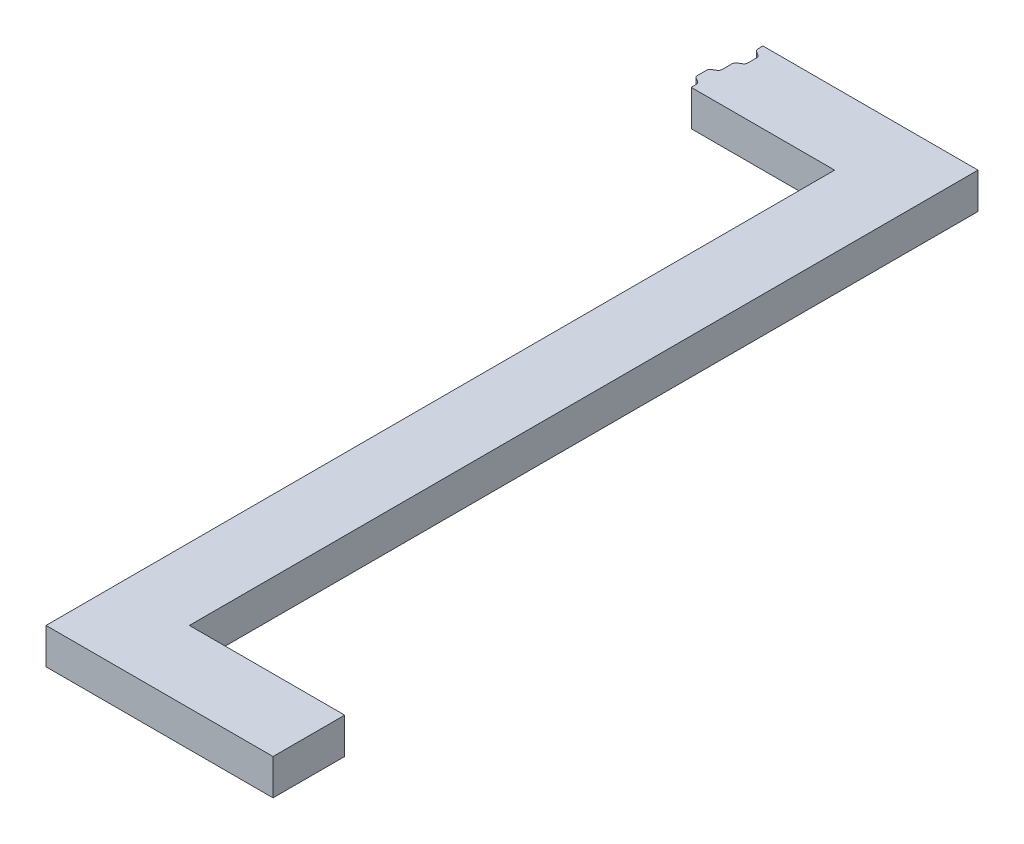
ISO-10303-21;
HEADER;
FILE_DESCRIPTION(('STEP AP214'),'2;1');
FILE_NAME('part.step','',(''),(''),'','','');
FILE_SCHEMA(('AUTOMOTIVE_DESIGN { 1 0 10303 214 1 1 1 1 }'));
ENDSEC;
DATA;
#1=APPLICATION_CONTEXT('core data for automotive mechanical design processes');
#2=APPLICATION_PROTOCOL_DEFINITION('international standard','automotive_design',2000,#1);
#3=PRODUCT_CONTEXT('',#1,'mechanical');
#4=PRODUCT('Part','Part','',(#3));
#5=PRODUCT_RELATED_PRODUCT_CATEGORY('part','',(#4));
#6=PRODUCT_DEFINITION_FORMATION('','',#4);
#7=PRODUCT_DEFINITION_CONTEXT('part definition',#1,'design');
#8=PRODUCT_DEFINITION('design','',#6,#7);
#9=PRODUCT_DEFINITION_SHAPE('','',#8);
#10=(LENGTH_UNIT() NAMED_UNIT(*) SI_UNIT(.MILLI.,.METRE.));
#11=(NAMED_UNIT(*) PLANE_ANGLE_UNIT() SI_UNIT($,.RADIAN.));
#12=(NAMED_UNIT(*) SI_UNIT($,.STERADIAN.) SOLID_ANGLE_UNIT());
#13=UNCERTAINTY_MEASURE_WITH_UNIT(LENGTH_MEASURE(1.E-05),#10,'distance_accuracy_value','');
#14=(GEOMETRIC_REPRESENTATION_CONTEXT(3) GLOBAL_UNCERTAINTY_ASSIGNED_CONTEXT((#13)) GLOBAL_UNIT_ASSIGNED_CONTEXT((#10,
#11,#12)) REPRESENTATION_CONTEXT('',''));
#15=CARTESIAN_POINT('',(0.,0.,0.));
#16=DIRECTION('',(0.,0.,1.));
#17=DIRECTION('',(1.,0.,0.));
#18=AXIS2_PLACEMENT_3D('',#15,#16,#17);
#19=CARTESIAN_POINT('',(90.0000000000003,15.,300.));
#20=DIRECTION('',(0.,0.,1.));
#21=DIRECTION('',(1.,0.,0.));
#22=AXIS2_PLACEMENT_3D('',#19,#20,#21);
#23=PLANE('',#22);
#24=DIRECTION('',(-1.,0.,0.));
#25=VECTOR('',#24,1.);
#26=CARTESIAN_POINT('',(90.0000000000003,0.,300.));
#27=LINE('',#26,#25);
#28=CARTESIAN_POINT('',(155.,0.,300.));
#29=VERTEX_POINT('',#28);
#30=CARTESIAN_POINT('',(90.0000000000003,0.,300.));
#31=VERTEX_POINT('',#30);
#32=EDGE_CURVE('E202',#29,#31,#27,.T.);
#33=ORIENTED_EDGE('',*,*,#32,.T.);
#34=DIRECTION('',(0.,-1.,0.));
#35=VECTOR('',#34,1.);
#36=CARTESIAN_POINT('',(90.0000000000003,15.,300.));
#37=LINE('',#36,#35);
#38=CARTESIAN_POINT('',(90.0000000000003,15.,300.));
#39=VERTEX_POINT('',#38);
#40=EDGE_CURVE('E11',#39,#31,#37,.T.);
#41=ORIENTED_EDGE('',*,*,#40,.F.);
#42=DIRECTION('',(-1.,0.,0.));
#43=VECTOR('',#42,1.);
#44=CARTESIAN_POINT('',(90.0000000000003,15.,300.));
#45=LINE('',#44,#43);
#46=CARTESIAN_POINT('',(155.,15.,300.));
#47=VERTEX_POINT('',#46);
#48=EDGE_CURVE('E265',#47,#39,#45,.T.);
#49=ORIENTED_EDGE('',*,*,#48,.F.);
#50=DIRECTION('',(0.,-1.,0.));
#51=VECTOR('',#50,1.);
#52=CARTESIAN_POINT('',(155.,15.,300.));
#53=LINE('',#52,#51);
#54=EDGE_CURVE('E215',#47,#29,#53,.T.);
#55=ORIENTED_EDGE('',*,*,#54,.T.);
#56=EDGE_LOOP('',(#33,#41,#49,#55));
#57=FACE_BOUND('',#56,.T.);
#58=ADVANCED_FACE('F26',(#57),#23,.F.);
#59=CARTESIAN_POINT('',(90.,15.,-30.));
#60=DIRECTION('',(-1.,0.,0.));
#61=DIRECTION('',(0.,0.,1.));
#62=AXIS2_PLACEMENT_3D('',#59,#60,#61);
#63=PLANE('',#62);
#64=DIRECTION('',(0.,0.,-1.));
#65=VECTOR('',#64,1.);
#66=CARTESIAN_POINT('',(90.,0.,-30.));
#67=LINE('',#66,#65);
#68=CARTESIAN_POINT('',(90.,0.,-30.));
#69=VERTEX_POINT('',#68);
#70=EDGE_CURVE('E198',#31,#69,#67,.T.);
#71=ORIENTED_EDGE('',*,*,#70,.T.);
#72=DIRECTION('',(0.,-1.,0.));
#73=VECTOR('',#72,1.);
#74=CARTESIAN_POINT('',(90.,15.,-30.));
#75=LINE('',#74,#73);
#76=CARTESIAN_POINT('',(90.,15.,-30.));
#77=VERTEX_POINT('',#76);
#78=EDGE_CURVE('E33',#77,#69,#75,.T.);
#79=ORIENTED_EDGE('',*,*,#78,.F.);
#80=DIRECTION('',(0.,0.,-1.));
#81=VECTOR('',#80,1.);
#82=CARTESIAN_POINT('',(90.,15.,-30.));
#83=LINE('',#82,#81);
#84=EDGE_CURVE('E211',#39,#77,#83,.T.);
#85=ORIENTED_EDGE('',*,*,#84,.F.);
#86=ORIENTED_EDGE('',*,*,#40,.T.);
#87=EDGE_LOOP('',(#71,#79,#85,#86));
#88=FACE_BOUND('',#87,.T.);
#89=ADVANCED_FACE('F210',(#88),#63,.F.);
#90=CARTESIAN_POINT('',(0.199999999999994,15.,-30.));
#91=DIRECTION('',(0.,0.,1.));
#92=DIRECTION('',(1.,0.,0.));
#93=AXIS2_PLACEMENT_3D('',#90,#91,#92);
#94=PLANE('',#93);
#95=DIRECTION('',(-1.,0.,0.));
#96=VECTOR('',#95,1.);
#97=CARTESIAN_POINT('',(0.199999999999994,0.,-30.));
#98=LINE('',#97,#96);
#99=CARTESIAN_POINT('',(0.199999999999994,0.,-30.));
#100=VERTEX_POINT('',#99);
#101=EDGE_CURVE('E204',#69,#100,#98,.T.);
#102=ORIENTED_EDGE('',*,*,#101,.T.);
#103=DIRECTION('',(0.,-1.,0.));
#104=VECTOR('',#103,1.);
#105=CARTESIAN_POINT('',(0.199999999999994,15.,-30.));
#106=LINE('',#105,#104);
#107=CARTESIAN_POINT('',(0.199999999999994,15.,-30.));
#108=VERTEX_POINT('',#107);
#109=EDGE_CURVE('E381',#108,#100,#106,.T.);
#110=ORIENTED_EDGE('',*,*,#109,.F.);
#111=DIRECTION('',(-1.,0.,0.));
#112=VECTOR('',#111,1.);
#113=CARTESIAN_POINT('',(0.199999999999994,15.,-30.));
#114=LINE('',#113,#112);
#115=EDGE_CURVE('E268',#77,#108,#114,.T.);
#116=ORIENTED_EDGE('',*,*,#115,.F.);
#117=ORIENTED_EDGE('',*,*,#78,.T.);
#118=EDGE_LOOP('',(#102,#110,#116,#117));
#119=FACE_BOUND('',#118,.T.);
#120=ADVANCED_FACE('F385',(#119),#94,.F.);
#121=CARTESIAN_POINT('',(0.199999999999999,15.,-29.8));
#122=DIRECTION('',(0.,-1.,0.));
#123=DIRECTION('',(0.,0.,-1.));
#124=AXIS2_PLACEMENT_3D('',#121,#122,#123);
#125=CYLINDRICAL_SURFACE('',#124,0.200000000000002);
#126=CARTESIAN_POINT('',(0.199999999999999,0.,-29.8));
#127=DIRECTION('',(0.,1.,0.));
#128=DIRECTION('',(0.,0.,-1.));
#129=AXIS2_PLACEMENT_3D('',#126,#127,#128);
#130=CIRCLE('',#129,0.200000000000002);
#131=CARTESIAN_POINT('',(0.,0.,-29.8));
#132=VERTEX_POINT('',#131);
#133=EDGE_CURVE('E219',#100,#132,#130,.T.);
#134=ORIENTED_EDGE('',*,*,#133,.T.);
#135=DIRECTION('',(0.,-1.,0.));
#136=VECTOR('',#135,1.);
#137=CARTESIAN_POINT('',(0.,15.,-29.8));
#138=LINE('',#137,#136);
#139=CARTESIAN_POINT('',(0.,15.,-29.8));
#140=VERTEX_POINT('',#139);
#141=EDGE_CURVE('E378',#140,#132,#138,.T.);
#142=ORIENTED_EDGE('',*,*,#141,.F.);
#143=CARTESIAN_POINT('',(0.199999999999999,15.,-29.8));
#144=DIRECTION('',(0.,1.,0.));
#145=DIRECTION('',(0.,0.,-1.));
#146=AXIS2_PLACEMENT_3D('',#143,#144,#145);
#147=CIRCLE('',#146,0.200000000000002);
#148=EDGE_CURVE('E270',#108,#140,#147,.T.);
#149=ORIENTED_EDGE('',*,*,#148,.F.);
#150=ORIENTED_EDGE('',*,*,#109,.T.);
#151=EDGE_LOOP('',(#134,#142,#149,#150));
#152=FACE_BOUND('',#151,.T.);
#153=ADVANCED_FACE('F393',(#152),#125,.T.);
#154=CARTESIAN_POINT('',(0.,15.,-29.8));
#155=DIRECTION('',(1.,0.,0.));
#156=DIRECTION('',(0.,0.,-1.));
#157=AXIS2_PLACEMENT_3D('',#154,#155,#156);
#158=PLANE('',#157);
#159=DIRECTION('',(0.,0.,1.));
#160=VECTOR('',#159,1.);
#161=CARTESIAN_POINT('',(0.,0.,-29.8));
#162=LINE('',#161,#160);
#163=CARTESIAN_POINT('',(0.,0.,-27.9237604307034));
#164=VERTEX_POINT('',#163);
#165=EDGE_CURVE('E221',#132,#164,#162,.T.);
#166=ORIENTED_EDGE('',*,*,#165,.T.);
#167=DIRECTION('',(0.,-1.,0.));
#168=VECTOR('',#167,1.);
#169=CARTESIAN_POINT('',(0.,15.,-27.9237604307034));
#170=LINE('',#169,#168);
#171=CARTESIAN_POINT('',(0.,15.,-27.9237604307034));
#172=VERTEX_POINT('',#171);
#173=EDGE_CURVE('E375',#172,#164,#170,.T.);
#174=ORIENTED_EDGE('',*,*,#173,.F.);
#175=DIRECTION('',(0.,0.,1.));
#176=VECTOR('',#175,1.);
#177=CARTESIAN_POINT('',(0.,15.,-29.8));
#178=LINE('',#177,#176);
#179=EDGE_CURVE('E272',#140,#172,#178,.T.);
#180=ORIENTED_EDGE('',*,*,#179,.F.);
#181=ORIENTED_EDGE('',*,*,#141,.T.);
#182=EDGE_LOOP('',(#166,#174,#180,#181));
#183=FACE_BOUND('',#182,.T.);
#184=ADVANCED_FACE('F396',(#183),#158,.F.);
#185=CARTESIAN_POINT('',(1.6,15.,-27.9237604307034));
#186=DIRECTION('',(0.,-1.,0.));
#187=DIRECTION('',(0.,0.,-1.));
#188=AXIS2_PLACEMENT_3D('',#185,#186,#187);
#189=CYLINDRICAL_SURFACE('',#188,1.60000000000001);
#190=CARTESIAN_POINT('',(1.6,0.,-27.9237604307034));
#191=DIRECTION('',(0.,1.,0.));
#192=DIRECTION('',(0.,0.,1.));
#193=AXIS2_PLACEMENT_3D('',#190,#191,#192);
#194=CIRCLE('',#193,1.60000000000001);
#195=CARTESIAN_POINT('',(0.800000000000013,0.,-26.5381197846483));
#196=VERTEX_POINT('',#195);
#197=EDGE_CURVE('E223',#164,#196,#194,.T.);
#198=ORIENTED_EDGE('',*,*,#197,.T.);
#199=DIRECTION('',(0.,-1.,0.));
#200=VECTOR('',#199,1.);
#201=CARTESIAN_POINT('',(0.800000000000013,15.,-26.5381197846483));
#202=LINE('',#201,#200);
#203=CARTESIAN_POINT('',(0.800000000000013,15.,-26.5381197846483));
#204=VERTEX_POINT('',#203);
#205=EDGE_CURVE('E372',#204,#196,#202,.T.);
#206=ORIENTED_EDGE('',*,*,#205,.F.);
#207=CARTESIAN_POINT('',(1.6,15.,-27.9237604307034));
#208=DIRECTION('',(0.,1.,0.));
#209=DIRECTION('',(0.,0.,1.));
#210=AXIS2_PLACEMENT_3D('',#207,#208,#209);
#211=CIRCLE('',#210,1.60000000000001);
#212=EDGE_CURVE('E274',#172,#204,#211,.T.);
#213=ORIENTED_EDGE('',*,*,#212,.F.);
#214=ORIENTED_EDGE('',*,*,#173,.T.);
#215=EDGE_LOOP('',(#198,#206,#213,#214));
#216=FACE_BOUND('',#215,.T.);
#217=ADVANCED_FACE('F401',(#216),#189,.T.);
#218=CARTESIAN_POINT('',(0.800000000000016,15.,-26.5381197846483));
#219=DIRECTION('',(0.499999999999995,0.,-0.866025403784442));
#220=DIRECTION('',(-0.866025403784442,0.,-0.499999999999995));
#221=AXIS2_PLACEMENT_3D('',#218,#219,#220);
#222=PLANE('',#221);
#223=DIRECTION('',(0.866025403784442,0.,0.499999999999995));
#224=VECTOR('',#223,1.);
#225=CARTESIAN_POINT('',(0.800000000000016,0.,-26.5381197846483));
#226=LINE('',#225,#224);
#227=CARTESIAN_POINT('',(2.19999999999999,0.,-25.7298294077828));
#228=VERTEX_POINT('',#227);
#229=EDGE_CURVE('E225',#196,#228,#226,.T.);
#230=ORIENTED_EDGE('',*,*,#229,.T.);
#231=DIRECTION('',(0.,-1.,0.));
#232=VECTOR('',#231,1.);
#233=CARTESIAN_POINT('',(2.19999999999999,15.,-25.7298294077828));
#234=LINE('',#233,#232);
#235=CARTESIAN_POINT('',(2.19999999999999,15.,-25.7298294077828));
#236=VERTEX_POINT('',#235);
#237=EDGE_CURVE('E369',#236,#228,#234,.T.);
#238=ORIENTED_EDGE('',*,*,#237,.F.);
#239=DIRECTION('',(0.866025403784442,0.,0.499999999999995));
#240=VECTOR('',#239,1.);
#241=CARTESIAN_POINT('',(0.800000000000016,15.,-26.5381197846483));
#242=LINE('',#241,#240);
#243=EDGE_CURVE('E276',#204,#236,#242,.T.);
#244=ORIENTED_EDGE('',*,*,#243,.F.);
#245=ORIENTED_EDGE('',*,*,#205,.T.);
#246=EDGE_LOOP('',(#230,#238,#244,#245));
#247=FACE_BOUND('',#246,.T.);
#248=ADVANCED_FACE('F407',(#247),#222,.F.);
#249=CARTESIAN_POINT('',(1.40000000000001,15.,-24.3441887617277));
#250=DIRECTION('',(0.,-1.,0.));
#251=DIRECTION('',(0.,0.,-1.));
#252=AXIS2_PLACEMENT_3D('',#249,#250,#251);
#253=CYLINDRICAL_SURFACE('',#252,1.6);
#254=CARTESIAN_POINT('',(1.40000000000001,0.,-24.3441887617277));
#255=DIRECTION('',(0.,-1.,0.));
#256=DIRECTION('',(0.,0.,-1.));
#257=AXIS2_PLACEMENT_3D('',#254,#255,#256);
#258=CIRCLE('',#257,1.6);
#259=CARTESIAN_POINT('',(3.,0.,-24.3441887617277));
#260=VERTEX_POINT('',#259);
#261=EDGE_CURVE('E227',#228,#260,#258,.T.);
#262=ORIENTED_EDGE('',*,*,#261,.T.);
#263=DIRECTION('',(0.,-1.,0.));
#264=VECTOR('',#263,1.);
#265=CARTESIAN_POINT('',(3.,15.,-24.3441887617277));
#266=LINE('',#265,#264);
#267=CARTESIAN_POINT('',(3.,15.,-24.3441887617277));
#268=VERTEX_POINT('',#267);
#269=EDGE_CURVE('E366',#268,#260,#266,.T.);
#270=ORIENTED_EDGE('',*,*,#269,.F.);
#271=CARTESIAN_POINT('',(1.40000000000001,15.,-24.3441887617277));
#272=DIRECTION('',(0.,-1.,0.));
#273=DIRECTION('',(0.,0.,-1.));
#274=AXIS2_PLACEMENT_3D('',#271,#272,#273);
#275=CIRCLE('',#274,1.6);
#276=EDGE_CURVE('E278',#236,#268,#275,.T.);
#277=ORIENTED_EDGE('',*,*,#276,.F.);
#278=ORIENTED_EDGE('',*,*,#237,.T.);
#279=EDGE_LOOP('',(#262,#270,#277,#278));
#280=FACE_BOUND('',#279,.T.);
#281=ADVANCED_FACE('F411',(#280),#253,.F.);
#282=CARTESIAN_POINT('',(3.,15.,-24.3441887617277));
#283=DIRECTION('',(1.,0.,0.));
#284=DIRECTION('',(0.,0.,-1.));
#285=AXIS2_PLACEMENT_3D('',#282,#283,#284);
#286=PLANE('',#285);
#287=DIRECTION('',(0.,0.,1.));
#288=VECTOR('',#287,1.);
#289=CARTESIAN_POINT('',(3.,0.,-24.3441887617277));
#290=LINE('',#289,#288);
#291=CARTESIAN_POINT('',(3.00000000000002,0.,-20.6603785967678));
#292=VERTEX_POINT('',#291);
#293=EDGE_CURVE('E229',#260,#292,#290,.T.);
#294=ORIENTED_EDGE('',*,*,#293,.T.);
#295=DIRECTION('',(0.,-1.,0.));
#296=VECTOR('',#295,1.);
#297=CARTESIAN_POINT('',(3.00000000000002,15.,-20.6603785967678));
#298=LINE('',#297,#296);
#299=CARTESIAN_POINT('',(3.00000000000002,15.,-20.6603785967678));
#300=VERTEX_POINT('',#299);
#301=EDGE_CURVE('E363',#300,#292,#298,.T.);
#302=ORIENTED_EDGE('',*,*,#301,.F.);
#303=DIRECTION('',(0.,0.,1.));
#304=VECTOR('',#303,1.);
#305=CARTESIAN_POINT('',(3.,15.,-24.3441887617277));
#306=LINE('',#305,#304);
#307=EDGE_CURVE('E280',#268,#300,#306,.T.);
#308=ORIENTED_EDGE('',*,*,#307,.F.);
#309=ORIENTED_EDGE('',*,*,#269,.T.);
#310=EDGE_LOOP('',(#294,#302,#308,#309));
#311=FACE_BOUND('',#310,.T.);
#312=ADVANCED_FACE('F416',(#311),#286,.F.);
#313=CARTESIAN_POINT('',(1.40000000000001,15.,-20.6603785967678));
#314=DIRECTION('',(0.,-1.,0.));
#315=DIRECTION('',(0.,0.,-1.));
#316=AXIS2_PLACEMENT_3D('',#313,#314,#315);
#317=CYLINDRICAL_SURFACE('',#316,1.6);
#318=CARTESIAN_POINT('',(1.40000000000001,0.,-20.6603785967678));
#319=DIRECTION('',(0.,-1.,0.));
#320=DIRECTION('',(0.,0.,-1.));
#321=AXIS2_PLACEMENT_3D('',#318,#319,#320);
#322=CIRCLE('',#321,1.6);
#323=CARTESIAN_POINT('',(2.20215355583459,0.,-19.2759835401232));
#324=VERTEX_POINT('',#323);
#325=EDGE_CURVE('E231',#292,#324,#322,.T.);
#326=ORIENTED_EDGE('',*,*,#325,.T.);
#327=DIRECTION('',(0.,-1.,0.));
#328=VECTOR('',#327,1.);
#329=CARTESIAN_POINT('',(2.20215355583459,15.,-19.2759835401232));
#330=LINE('',#329,#328);
#331=CARTESIAN_POINT('',(2.20215355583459,15.,-19.2759835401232));
#332=VERTEX_POINT('',#331);
#333=EDGE_CURVE('E360',#332,#324,#330,.T.);
#334=ORIENTED_EDGE('',*,*,#333,.F.);
#335=CARTESIAN_POINT('',(1.40000000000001,15.,-20.6603785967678));
#336=DIRECTION('',(0.,-1.,0.));
#337=DIRECTION('',(0.,0.,-1.));
#338=AXIS2_PLACEMENT_3D('',#335,#336,#337);
#339=CIRCLE('',#338,1.6);
#340=EDGE_CURVE('E282',#300,#332,#339,.T.);
#341=ORIENTED_EDGE('',*,*,#340,.F.);
#342=ORIENTED_EDGE('',*,*,#301,.T.);
#343=EDGE_LOOP('',(#326,#334,#341,#342));
#344=FACE_BOUND('',#343,.T.);
#345=ADVANCED_FACE('F422',(#344),#317,.F.);
#346=CARTESIAN_POINT('',(2.20215355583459,15.,-19.2759835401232));
#347=DIRECTION('',(0.501345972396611,0.,0.865246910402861));
#348=DIRECTION('',(0.865246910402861,0.,-0.501345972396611));
#349=AXIS2_PLACEMENT_3D('',#346,#347,#348);
#350=PLANE('',#349);
#351=DIRECTION('',(-0.865246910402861,0.,0.501345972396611));
#352=VECTOR('',#351,1.);
#353=CARTESIAN_POINT('',(2.20215355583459,0.,-19.2759835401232));
#354=LINE('',#353,#352);
#355=CARTESIAN_POINT('',(0.797846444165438,0.,-18.4622924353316));
#356=VERTEX_POINT('',#355);
#357=EDGE_CURVE('E233',#324,#356,#354,.T.);
#358=ORIENTED_EDGE('',*,*,#357,.T.);
#359=DIRECTION('',(0.,-1.,0.));
#360=VECTOR('',#359,1.);
#361=CARTESIAN_POINT('',(0.797846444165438,15.,-18.4622924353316));
#362=LINE('',#361,#360);
#363=CARTESIAN_POINT('',(0.797846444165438,15.,-18.4622924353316));
#364=VERTEX_POINT('',#363);
#365=EDGE_CURVE('E357',#364,#356,#362,.T.);
#366=ORIENTED_EDGE('',*,*,#365,.F.);
#367=DIRECTION('',(-0.865246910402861,0.,0.501345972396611));
#368=VECTOR('',#367,1.);
#369=CARTESIAN_POINT('',(2.20215355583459,15.,-19.2759835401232));
#370=LINE('',#369,#368);
#371=EDGE_CURVE('E284',#332,#364,#370,.T.);
#372=ORIENTED_EDGE('',*,*,#371,.F.);
#373=ORIENTED_EDGE('',*,*,#333,.T.);
#374=EDGE_LOOP('',(#358,#366,#372,#373));
#375=FACE_BOUND('',#374,.T.);
#376=ADVANCED_FACE('F426',(#375),#350,.F.);
#377=CARTESIAN_POINT('',(1.6,15.,-17.077897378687));
#378=DIRECTION('',(0.,-1.,0.));
#379=DIRECTION('',(0.,0.,-1.));
#380=AXIS2_PLACEMENT_3D('',#377,#378,#379);
#381=CYLINDRICAL_SURFACE('',#380,1.6);
#382=CARTESIAN_POINT('',(1.6,0.,-17.077897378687));
#383=DIRECTION('',(0.,1.,0.));
#384=DIRECTION('',(0.,0.,1.));
#385=AXIS2_PLACEMENT_3D('',#382,#383,#384);
#386=CIRCLE('',#385,1.6);
#387=CARTESIAN_POINT('',(0.,0.,-17.077897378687));
#388=VERTEX_POINT('',#387);
#389=EDGE_CURVE('E235',#356,#388,#386,.T.);
#390=ORIENTED_EDGE('',*,*,#389,.T.);
#391=DIRECTION('',(0.,-1.,0.));
#392=VECTOR('',#391,1.);
#393=CARTESIAN_POINT('',(0.,15.,-17.077897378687));
#394=LINE('',#393,#392);
#395=CARTESIAN_POINT('',(0.,15.,-17.077897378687));
#396=VERTEX_POINT('',#395);
#397=EDGE_CURVE('E354',#396,#388,#394,.T.);
#398=ORIENTED_EDGE('',*,*,#397,.F.);
#399=CARTESIAN_POINT('',(1.6,15.,-17.077897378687));
#400=DIRECTION('',(0.,1.,0.));
#401=DIRECTION('',(0.,0.,1.));
#402=AXIS2_PLACEMENT_3D('',#399,#400,#401);
#403=CIRCLE('',#402,1.6);
#404=EDGE_CURVE('E286',#364,#396,#403,.T.);
#405=ORIENTED_EDGE('',*,*,#404,.F.);
#406=ORIENTED_EDGE('',*,*,#365,.T.);
#407=EDGE_LOOP('',(#390,#398,#405,#406));
#408=FACE_BOUND('',#407,.T.);
#409=ADVANCED_FACE('F431',(#408),#381,.T.);
#410=CARTESIAN_POINT('',(0.,15.,-17.077897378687));
#411=DIRECTION('',(1.,0.,0.));
#412=DIRECTION('',(0.,0.,-1.));
#413=AXIS2_PLACEMENT_3D('',#410,#411,#412);
#414=PLANE('',#413);
#415=DIRECTION('',(0.,0.,1.));
#416=VECTOR('',#415,1.);
#417=CARTESIAN_POINT('',(0.,0.,-17.077897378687));
#418=LINE('',#417,#416);
#419=CARTESIAN_POINT('',(0.,0.,-12.922102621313));
#420=VERTEX_POINT('',#419);
#421=EDGE_CURVE('E237',#388,#420,#418,.T.);
#422=ORIENTED_EDGE('',*,*,#421,.T.);
#423=DIRECTION('',(0.,-1.,0.));
#424=VECTOR('',#423,1.);
#425=CARTESIAN_POINT('',(0.,15.,-12.922102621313));
#426=LINE('',#425,#424);
#427=CARTESIAN_POINT('',(0.,15.,-12.922102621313));
#428=VERTEX_POINT('',#427);
#429=EDGE_CURVE('E351',#428,#420,#426,.T.);
#430=ORIENTED_EDGE('',*,*,#429,.F.);
#431=DIRECTION('',(0.,0.,1.));
#432=VECTOR('',#431,1.);
#433=CARTESIAN_POINT('',(0.,15.,-17.077897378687));
#434=LINE('',#433,#432);
#435=EDGE_CURVE('E288',#396,#428,#434,.T.);
#436=ORIENTED_EDGE('',*,*,#435,.F.);
#437=ORIENTED_EDGE('',*,*,#397,.T.);
#438=EDGE_LOOP('',(#422,#430,#436,#437));
#439=FACE_BOUND('',#438,.T.);
#440=ADVANCED_FACE('F437',(#439),#414,.F.);
#441=CARTESIAN_POINT('',(-1.6,15.,-12.922102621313));
#442=DIRECTION('',(0.,-1.,0.));
#443=DIRECTION('',(0.,0.,-1.));
#444=AXIS2_PLACEMENT_3D('',#441,#442,#443);
#445=CYLINDRICAL_SURFACE('',#444,1.6);
#446=CARTESIAN_POINT('',(-1.6,0.,-12.922102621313));
#447=DIRECTION('',(0.,-1.,0.));
#448=DIRECTION('',(0.,0.,1.));
#449=AXIS2_PLACEMENT_3D('',#446,#447,#448);
#450=CIRCLE('',#449,1.6);
#451=CARTESIAN_POINT('',(-0.797846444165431,0.,-11.5377075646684));
#452=VERTEX_POINT('',#451);
#453=EDGE_CURVE('E239',#420,#452,#450,.T.);
#454=ORIENTED_EDGE('',*,*,#453,.T.);
#455=DIRECTION('',(0.,-1.,0.));
#456=VECTOR('',#455,1.);
#457=CARTESIAN_POINT('',(-0.797846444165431,15.,-11.5377075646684));
#458=LINE('',#457,#456);
#459=CARTESIAN_POINT('',(-0.797846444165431,15.,-11.5377075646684));
#460=VERTEX_POINT('',#459);
#461=EDGE_CURVE('E348',#460,#452,#458,.T.);
#462=ORIENTED_EDGE('',*,*,#461,.F.);
#463=CARTESIAN_POINT('',(-1.6,15.,-12.922102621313));
#464=DIRECTION('',(0.,-1.,0.));
#465=DIRECTION('',(0.,0.,1.));
#466=AXIS2_PLACEMENT_3D('',#463,#464,#465);
#467=CIRCLE('',#466,1.6);
#468=EDGE_CURVE('E290',#428,#460,#467,.T.);
#469=ORIENTED_EDGE('',*,*,#468,.F.);
#470=ORIENTED_EDGE('',*,*,#429,.T.);
#471=EDGE_LOOP('',(#454,#462,#469,#470));
#472=FACE_BOUND('',#471,.T.);
#473=ADVANCED_FACE('F441',(#472),#445,.F.);
#474=CARTESIAN_POINT('',(-2.20215355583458,15.,-10.7240164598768));
#475=DIRECTION('',(0.50134597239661,0.,0.865246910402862));
#476=DIRECTION('',(0.865246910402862,0.,-0.50134597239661));
#477=AXIS2_PLACEMENT_3D('',#474,#475,#476);
#478=PLANE('',#477);
#479=DIRECTION('',(-0.865246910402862,0.,0.50134597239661));
#480=VECTOR('',#479,1.);
#481=CARTESIAN_POINT('',(-2.20215355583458,0.,-10.7240164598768));
#482=LINE('',#481,#480);
#483=CARTESIAN_POINT('',(-2.20215355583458,0.,-10.7240164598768));
#484=VERTEX_POINT('',#483);
#485=EDGE_CURVE('E241',#452,#484,#482,.T.);
#486=ORIENTED_EDGE('',*,*,#485,.T.);
#487=DIRECTION('',(0.,-1.,0.));
#488=VECTOR('',#487,1.);
#489=CARTESIAN_POINT('',(-2.20215355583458,15.,-10.7240164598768));
#490=LINE('',#489,#488);
#491=CARTESIAN_POINT('',(-2.20215355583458,15.,-10.7240164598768));
#492=VERTEX_POINT('',#491);
#493=EDGE_CURVE('E345',#492,#484,#490,.T.);
#494=ORIENTED_EDGE('',*,*,#493,.F.);
#495=DIRECTION('',(-0.865246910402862,0.,0.50134597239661));
#496=VECTOR('',#495,1.);
#497=CARTESIAN_POINT('',(-2.20215355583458,15.,-10.7240164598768));
#498=LINE('',#497,#496);
#499=EDGE_CURVE('E292',#460,#492,#498,.T.);
#500=ORIENTED_EDGE('',*,*,#499,.F.);
#501=ORIENTED_EDGE('',*,*,#461,.T.);
#502=EDGE_LOOP('',(#486,#494,#500,#501));
#503=FACE_BOUND('',#502,.T.);
#504=ADVANCED_FACE('F446',(#503),#478,.F.);
#505=CARTESIAN_POINT('',(-1.40000000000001,15.,-9.33962140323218));
#506=DIRECTION('',(0.,-1.,0.));
#507=DIRECTION('',(0.,0.,-1.));
#508=AXIS2_PLACEMENT_3D('',#505,#506,#507);
#509=CYLINDRICAL_SURFACE('',#508,1.6);
#510=CARTESIAN_POINT('',(-1.40000000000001,0.,-9.33962140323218));
#511=DIRECTION('',(0.,1.,0.));
#512=DIRECTION('',(0.,0.,-1.));
#513=AXIS2_PLACEMENT_3D('',#510,#511,#512);
#514=CIRCLE('',#513,1.6);
#515=CARTESIAN_POINT('',(-3.00000000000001,0.,-9.33962140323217));
#516=VERTEX_POINT('',#515);
#517=EDGE_CURVE('E243',#484,#516,#514,.T.);
#518=ORIENTED_EDGE('',*,*,#517,.T.);
#519=DIRECTION('',(0.,-1.,0.));
#520=VECTOR('',#519,1.);
#521=CARTESIAN_POINT('',(-3.00000000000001,15.,-9.33962140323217));
#522=LINE('',#521,#520);
#523=CARTESIAN_POINT('',(-3.00000000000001,15.,-9.33962140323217));
#524=VERTEX_POINT('',#523);
#525=EDGE_CURVE('E342',#524,#516,#522,.T.);
#526=ORIENTED_EDGE('',*,*,#525,.F.);
#527=CARTESIAN_POINT('',(-1.40000000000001,15.,-9.33962140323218));
#528=DIRECTION('',(0.,1.,0.));
#529=DIRECTION('',(0.,0.,-1.));
#530=AXIS2_PLACEMENT_3D('',#527,#528,#529);
#531=CIRCLE('',#530,1.6);
#532=EDGE_CURVE('E294',#492,#524,#531,.T.);
#533=ORIENTED_EDGE('',*,*,#532,.F.);
#534=ORIENTED_EDGE('',*,*,#493,.T.);
#535=EDGE_LOOP('',(#518,#526,#533,#534));
#536=FACE_BOUND('',#535,.T.);
#537=ADVANCED_FACE('F452',(#536),#509,.T.);
#538=CARTESIAN_POINT('',(-2.99999999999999,15.,-5.65581123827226));
#539=DIRECTION('',(1.,0.,0.));
#540=DIRECTION('',(0.,0.,-1.));
#541=AXIS2_PLACEMENT_3D('',#538,#539,#540);
#542=PLANE('',#541);
#543=DIRECTION('',(0.,0.,1.));
#544=VECTOR('',#543,1.);
#545=CARTESIAN_POINT('',(-2.99999999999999,0.,-5.65581123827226));
#546=LINE('',#545,#544);
#547=CARTESIAN_POINT('',(-2.99999999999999,0.,-5.65581123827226));
#548=VERTEX_POINT('',#547);
#549=EDGE_CURVE('E245',#516,#548,#546,.T.);
#550=ORIENTED_EDGE('',*,*,#549,.T.);
#551=DIRECTION('',(0.,-1.,0.));
#552=VECTOR('',#551,1.);
#553=CARTESIAN_POINT('',(-2.99999999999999,15.,-5.65581123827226));
#554=LINE('',#553,#552);
#555=CARTESIAN_POINT('',(-2.99999999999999,15.,-5.65581123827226));
#556=VERTEX_POINT('',#555);
#557=EDGE_CURVE('E339',#556,#548,#554,.T.);
#558=ORIENTED_EDGE('',*,*,#557,.F.);
#559=DIRECTION('',(0.,0.,1.));
#560=VECTOR('',#559,1.);
#561=CARTESIAN_POINT('',(-2.99999999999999,15.,-5.65581123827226));
#562=LINE('',#561,#560);
#563=EDGE_CURVE('E296',#524,#556,#562,.T.);
#564=ORIENTED_EDGE('',*,*,#563,.F.);
#565=ORIENTED_EDGE('',*,*,#525,.T.);
#566=EDGE_LOOP('',(#550,#558,#564,#565));
#567=FACE_BOUND('',#566,.T.);
#568=ADVANCED_FACE('F456',(#567),#542,.F.);
#569=CARTESIAN_POINT('',(-1.4,15.,-5.65581123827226));
#570=DIRECTION('',(0.,-1.,0.));
#571=DIRECTION('',(0.,0.,-1.));
#572=AXIS2_PLACEMENT_3D('',#569,#570,#571);
#573=CYLINDRICAL_SURFACE('',#572,1.59999999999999);
#574=CARTESIAN_POINT('',(-1.4,0.,-5.65581123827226));
#575=DIRECTION('',(0.,1.,0.));
#576=DIRECTION('',(0.,0.,-1.));
#577=AXIS2_PLACEMENT_3D('',#574,#575,#576);
#578=CIRCLE('',#577,1.59999999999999);
#579=CARTESIAN_POINT('',(-2.19999999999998,0.,-4.27017059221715));
#580=VERTEX_POINT('',#579);
#581=EDGE_CURVE('E247',#548,#580,#578,.T.);
#582=ORIENTED_EDGE('',*,*,#581,.T.);
#583=DIRECTION('',(0.,-1.,0.));
#584=VECTOR('',#583,1.);
#585=CARTESIAN_POINT('',(-2.19999999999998,15.,-4.27017059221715));
#586=LINE('',#585,#584);
#587=CARTESIAN_POINT('',(-2.19999999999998,15.,-4.27017059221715));
#588=VERTEX_POINT('',#587);
#589=EDGE_CURVE('E336',#588,#580,#586,.T.);
#590=ORIENTED_EDGE('',*,*,#589,.F.);
#591=CARTESIAN_POINT('',(-1.4,15.,-5.65581123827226));
#592=DIRECTION('',(0.,1.,0.));
#593=DIRECTION('',(0.,0.,-1.));
#594=AXIS2_PLACEMENT_3D('',#591,#592,#593);
#595=CIRCLE('',#594,1.59999999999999);
#596=EDGE_CURVE('E298',#556,#588,#595,.T.);
#597=ORIENTED_EDGE('',*,*,#596,.F.);
#598=ORIENTED_EDGE('',*,*,#557,.T.);
#599=EDGE_LOOP('',(#582,#590,#597,#598));
#600=FACE_BOUND('',#599,.T.);
#601=ADVANCED_FACE('F461',(#600),#573,.T.);
#602=CARTESIAN_POINT('',(-0.800000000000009,15.,-3.4618802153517));
#603=DIRECTION('',(0.499999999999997,0.,-0.866025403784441));
#604=DIRECTION('',(-0.866025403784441,0.,-0.499999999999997));
#605=AXIS2_PLACEMENT_3D('',#602,#603,#604);
#606=PLANE('',#605);
#607=DIRECTION('',(0.866025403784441,0.,0.499999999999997));
#608=VECTOR('',#607,1.);
#609=CARTESIAN_POINT('',(-0.800000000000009,0.,-3.4618802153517));
#610=LINE('',#609,#608);
#611=CARTESIAN_POINT('',(-0.800000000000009,0.,-3.4618802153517));
#612=VERTEX_POINT('',#611);
#613=EDGE_CURVE('E249',#580,#612,#610,.T.);
#614=ORIENTED_EDGE('',*,*,#613,.T.);
#615=DIRECTION('',(0.,-1.,0.));
#616=VECTOR('',#615,1.);
#617=CARTESIAN_POINT('',(-0.800000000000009,15.,-3.4618802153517));
#618=LINE('',#617,#616);
#619=CARTESIAN_POINT('',(-0.800000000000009,15.,-3.4618802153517));
#620=VERTEX_POINT('',#619);
#621=EDGE_CURVE('E333',#620,#612,#618,.T.);
#622=ORIENTED_EDGE('',*,*,#621,.F.);
#623=DIRECTION('',(0.866025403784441,0.,0.499999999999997));
#624=VECTOR('',#623,1.);
#625=CARTESIAN_POINT('',(-0.800000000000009,15.,-3.4618802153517));
#626=LINE('',#625,#624);
#627=EDGE_CURVE('E300',#588,#620,#626,.T.);
#628=ORIENTED_EDGE('',*,*,#627,.F.);
#629=ORIENTED_EDGE('',*,*,#589,.T.);
#630=EDGE_LOOP('',(#614,#622,#628,#629));
#631=FACE_BOUND('',#630,.T.);
#632=ADVANCED_FACE('F467',(#631),#606,.F.);
#633=CARTESIAN_POINT('',(-1.59999999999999,15.,-2.07623956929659));
#634=DIRECTION('',(0.,-1.,0.));
#635=DIRECTION('',(0.,0.,-1.));
#636=AXIS2_PLACEMENT_3D('',#633,#634,#635);
#637=CYLINDRICAL_SURFACE('',#636,1.59999999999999);
#638=CARTESIAN_POINT('',(-1.59999999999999,0.,-2.07623956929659));
#639=DIRECTION('',(0.,-1.,0.));
#640=DIRECTION('',(0.,0.,1.));
#641=AXIS2_PLACEMENT_3D('',#638,#639,#640);
#642=CIRCLE('',#641,1.59999999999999);
#643=CARTESIAN_POINT('',(0.,0.,-2.07623956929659));
#644=VERTEX_POINT('',#643);
#645=EDGE_CURVE('E251',#612,#644,#642,.T.);
#646=ORIENTED_EDGE('',*,*,#645,.T.);
#647=DIRECTION('',(0.,-1.,0.));
#648=VECTOR('',#647,1.);
#649=CARTESIAN_POINT('',(0.,15.,-2.07623956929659));
#650=LINE('',#649,#648);
#651=CARTESIAN_POINT('',(0.,15.,-2.07623956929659));
#652=VERTEX_POINT('',#651);
#653=EDGE_CURVE('E330',#652,#644,#650,.T.);
#654=ORIENTED_EDGE('',*,*,#653,.F.);
#655=CARTESIAN_POINT('',(-1.59999999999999,15.,-2.07623956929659));
#656=DIRECTION('',(0.,-1.,0.));
#657=DIRECTION('',(0.,0.,1.));
#658=AXIS2_PLACEMENT_3D('',#655,#656,#657);
#659=CIRCLE('',#658,1.59999999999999);
#660=EDGE_CURVE('E302',#620,#652,#659,.T.);
#661=ORIENTED_EDGE('',*,*,#660,.F.);
#662=ORIENTED_EDGE('',*,*,#621,.T.);
#663=EDGE_LOOP('',(#646,#654,#661,#662));
#664=FACE_BOUND('',#663,.T.);
#665=ADVANCED_FACE('F471',(#664),#637,.F.);
#666=CARTESIAN_POINT('',(0.,15.,-0.200000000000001));
#667=DIRECTION('',(1.,0.,0.));
#668=DIRECTION('',(0.,0.,-1.));
#669=AXIS2_PLACEMENT_3D('',#666,#667,#668);
#670=PLANE('',#669);
#671=DIRECTION('',(0.,0.,1.));
#672=VECTOR('',#671,1.);
#673=CARTESIAN_POINT('',(0.,0.,-0.200000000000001));
#674=LINE('',#673,#672);
#675=CARTESIAN_POINT('',(0.,0.,-0.200000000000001));
#676=VERTEX_POINT('',#675);
#677=EDGE_CURVE('E253',#644,#676,#674,.T.);
#678=ORIENTED_EDGE('',*,*,#677,.T.);
#679=DIRECTION('',(0.,-1.,0.));
#680=VECTOR('',#679,1.);
#681=CARTESIAN_POINT('',(0.,15.,-0.200000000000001));
#682=LINE('',#681,#680);
#683=CARTESIAN_POINT('',(0.,15.,-0.200000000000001));
#684=VERTEX_POINT('',#683);
#685=EDGE_CURVE('E327',#684,#676,#682,.T.);
#686=ORIENTED_EDGE('',*,*,#685,.F.);
#687=DIRECTION('',(0.,0.,1.));
#688=VECTOR('',#687,1.);
#689=CARTESIAN_POINT('',(0.,15.,-0.200000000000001));
#690=LINE('',#689,#688);
#691=EDGE_CURVE('E304',#652,#684,#690,.T.);
#692=ORIENTED_EDGE('',*,*,#691,.F.);
#693=ORIENTED_EDGE('',*,*,#653,.T.);
#694=EDGE_LOOP('',(#678,#686,#692,#693));
#695=FACE_BOUND('',#694,.T.);
#696=ADVANCED_FACE('F476',(#695),#670,.F.);
#697=CARTESIAN_POINT('',(0.199999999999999,15.,-0.2));
#698=DIRECTION('',(0.,-1.,0.));
#699=DIRECTION('',(0.,0.,-1.));
#700=AXIS2_PLACEMENT_3D('',#697,#698,#699);
#701=CYLINDRICAL_SURFACE('',#700,0.200000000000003);
#702=CARTESIAN_POINT('',(0.199999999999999,0.,-0.2));
#703=DIRECTION('',(0.,1.,0.));
#704=DIRECTION('',(0.,0.,1.));
#705=AXIS2_PLACEMENT_3D('',#702,#703,#704);
#706=CIRCLE('',#705,0.200000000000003);
#707=CARTESIAN_POINT('',(0.199999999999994,0.,0.));
#708=VERTEX_POINT('',#707);
#709=EDGE_CURVE('E255',#676,#708,#706,.T.);
#710=ORIENTED_EDGE('',*,*,#709,.T.);
#711=DIRECTION('',(0.,-1.,0.));
#712=VECTOR('',#711,1.);
#713=CARTESIAN_POINT('',(0.199999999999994,15.,0.));
#714=LINE('',#713,#712);
#715=CARTESIAN_POINT('',(0.199999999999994,15.,0.));
#716=VERTEX_POINT('',#715);
#717=EDGE_CURVE('E324',#716,#708,#714,.T.);
#718=ORIENTED_EDGE('',*,*,#717,.F.);
#719=CARTESIAN_POINT('',(0.199999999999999,15.,-0.2));
#720=DIRECTION('',(0.,1.,0.));
#721=DIRECTION('',(0.,0.,1.));
#722=AXIS2_PLACEMENT_3D('',#719,#720,#721);
#723=CIRCLE('',#722,0.200000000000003);
#724=EDGE_CURVE('E306',#684,#716,#723,.T.);
#725=ORIENTED_EDGE('',*,*,#724,.F.);
#726=ORIENTED_EDGE('',*,*,#685,.T.);
#727=EDGE_LOOP('',(#710,#718,#725,#726));
#728=FACE_BOUND('',#727,.T.);
#729=ADVANCED_FACE('F482',(#728),#701,.T.);
#730=CARTESIAN_POINT('',(0.199999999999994,15.,0.));
#731=DIRECTION('',(0.,0.,-1.));
#732=DIRECTION('',(-1.,0.,0.));
#733=AXIS2_PLACEMENT_3D('',#730,#731,#732);
#734=PLANE('',#733);
#735=DIRECTION('',(1.,0.,0.));
#736=VECTOR('',#735,1.);
#737=CARTESIAN_POINT('',(0.199999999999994,0.,0.));
#738=LINE('',#737,#736);
#739=CARTESIAN_POINT('',(60.,0.,0.));
#740=VERTEX_POINT('',#739);
#741=EDGE_CURVE('E257',#708,#740,#738,.T.);
#742=ORIENTED_EDGE('',*,*,#741,.T.);
#743=DIRECTION('',(0.,-1.,0.));
#744=VECTOR('',#743,1.);
#745=CARTESIAN_POINT('',(60.,15.,0.));
#746=LINE('',#745,#744);
#747=CARTESIAN_POINT('',(60.,15.,0.));
#748=VERTEX_POINT('',#747);
#749=EDGE_CURVE('E321',#748,#740,#746,.T.);
#750=ORIENTED_EDGE('',*,*,#749,.F.);
#751=DIRECTION('',(1.,0.,0.));
#752=VECTOR('',#751,1.);
#753=CARTESIAN_POINT('',(0.199999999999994,15.,0.));
#754=LINE('',#753,#752);
#755=EDGE_CURVE('E308',#716,#748,#754,.T.);
#756=ORIENTED_EDGE('',*,*,#755,.F.);
#757=ORIENTED_EDGE('',*,*,#717,.T.);
#758=EDGE_LOOP('',(#742,#750,#756,#757));
#759=FACE_BOUND('',#758,.T.);
#760=ADVANCED_FACE('F486',(#759),#734,.F.);
#761=CARTESIAN_POINT('',(60.,15.,330.));
#762=DIRECTION('',(1.,0.,0.));
#763=DIRECTION('',(0.,0.,-1.));
#764=AXIS2_PLACEMENT_3D('',#761,#762,#763);
#765=PLANE('',#764);
#766=DIRECTION('',(0.,0.,1.));
#767=VECTOR('',#766,1.);
#768=CARTESIAN_POINT('',(60.,0.,330.));
#769=LINE('',#768,#767);
#770=CARTESIAN_POINT('',(60.,0.,330.));
#771=VERTEX_POINT('',#770);
#772=EDGE_CURVE('E259',#740,#771,#769,.T.);
#773=ORIENTED_EDGE('',*,*,#772,.T.);
#774=DIRECTION('',(0.,-1.,0.));
#775=VECTOR('',#774,1.);
#776=CARTESIAN_POINT('',(60.,15.,330.));
#777=LINE('',#776,#775);
#778=CARTESIAN_POINT('',(60.,15.,330.));
#779=VERTEX_POINT('',#778);
#780=EDGE_CURVE('E318',#779,#771,#777,.T.);
#781=ORIENTED_EDGE('',*,*,#780,.F.);
#782=DIRECTION('',(0.,0.,1.));
#783=VECTOR('',#782,1.);
#784=CARTESIAN_POINT('',(60.,15.,330.));
#785=LINE('',#784,#783);
#786=EDGE_CURVE('E310',#748,#779,#785,.T.);
#787=ORIENTED_EDGE('',*,*,#786,.F.);
#788=ORIENTED_EDGE('',*,*,#749,.T.);
#789=EDGE_LOOP('',(#773,#781,#787,#788));
#790=FACE_BOUND('',#789,.T.);
#791=ADVANCED_FACE('F491',(#790),#765,.F.);
#792=CARTESIAN_POINT('',(155.,15.,330.));
#793=DIRECTION('',(0.,0.,-1.));
#794=DIRECTION('',(-1.,0.,0.));
#795=AXIS2_PLACEMENT_3D('',#792,#793,#794);
#796=PLANE('',#795);
#797=DIRECTION('',(1.,0.,0.));
#798=VECTOR('',#797,1.);
#799=CARTESIAN_POINT('',(155.,0.,330.));
#800=LINE('',#799,#798);
#801=CARTESIAN_POINT('',(155.,0.,330.));
#802=VERTEX_POINT('',#801);
#803=EDGE_CURVE('E261',#771,#802,#800,.T.);
#804=ORIENTED_EDGE('',*,*,#803,.T.);
#805=DIRECTION('',(0.,-1.,0.));
#806=VECTOR('',#805,1.);
#807=CARTESIAN_POINT('',(155.,15.,330.));
#808=LINE('',#807,#806);
#809=CARTESIAN_POINT('',(155.,15.,330.));
#810=VERTEX_POINT('',#809);
#811=EDGE_CURVE('E315',#810,#802,#808,.T.);
#812=ORIENTED_EDGE('',*,*,#811,.F.);
#813=DIRECTION('',(1.,0.,0.));
#814=VECTOR('',#813,1.);
#815=CARTESIAN_POINT('',(155.,15.,330.));
#816=LINE('',#815,#814);
#817=EDGE_CURVE('E45',#779,#810,#816,.T.);
#818=ORIENTED_EDGE('',*,*,#817,.F.);
#819=ORIENTED_EDGE('',*,*,#780,.T.);
#820=EDGE_LOOP('',(#804,#812,#818,#819));
#821=FACE_BOUND('',#820,.T.);
#822=ADVANCED_FACE('F494',(#821),#796,.F.);
#823=CARTESIAN_POINT('',(155.,15.,300.));
#824=DIRECTION('',(-1.,0.,0.));
#825=DIRECTION('',(0.,0.,1.));
#826=AXIS2_PLACEMENT_3D('',#823,#824,#825);
#827=PLANE('',#826);
#828=DIRECTION('',(0.,0.,-1.));
#829=VECTOR('',#828,1.);
#830=CARTESIAN_POINT('',(155.,0.,300.));
#831=LINE('',#830,#829);
#832=EDGE_CURVE('E263',#802,#29,#831,.T.);
#833=ORIENTED_EDGE('',*,*,#832,.T.);
#834=ORIENTED_EDGE('',*,*,#54,.F.);
#835=DIRECTION('',(0.,0.,-1.));
#836=VECTOR('',#835,1.);
#837=CARTESIAN_POINT('',(155.,15.,300.));
#838=LINE('',#837,#836);
#839=EDGE_CURVE('E40',#810,#47,#838,.T.);
#840=ORIENTED_EDGE('',*,*,#839,.F.);
#841=ORIENTED_EDGE('',*,*,#811,.T.);
#842=EDGE_LOOP('',(#833,#834,#840,#841));
#843=FACE_BOUND('',#842,.T.);
#844=ADVANCED_FACE('F496',(#843),#827,.F.);
#845=CARTESIAN_POINT('',(0.199999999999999,15.,-0.2));
#846=DIRECTION('',(0.,1.,0.));
#847=DIRECTION('',(0.,0.,1.));
#848=AXIS2_PLACEMENT_3D('',#845,#846,#847);
#849=PLANE('',#848);
#850=ORIENTED_EDGE('',*,*,#48,.T.);
#851=ORIENTED_EDGE('',*,*,#84,.T.);
#852=ORIENTED_EDGE('',*,*,#115,.T.);
#853=ORIENTED_EDGE('',*,*,#148,.T.);
#854=ORIENTED_EDGE('',*,*,#179,.T.);
#855=ORIENTED_EDGE('',*,*,#212,.T.);
#856=ORIENTED_EDGE('',*,*,#243,.T.);
#857=ORIENTED_EDGE('',*,*,#276,.T.);
#858=ORIENTED_EDGE('',*,*,#307,.T.);
#859=ORIENTED_EDGE('',*,*,#340,.T.);
#860=ORIENTED_EDGE('',*,*,#371,.T.);
#861=ORIENTED_EDGE('',*,*,#404,.T.);
#862=ORIENTED_EDGE('',*,*,#435,.T.);
#863=ORIENTED_EDGE('',*,*,#468,.T.);
#864=ORIENTED_EDGE('',*,*,#499,.T.);
#865=ORIENTED_EDGE('',*,*,#532,.T.);
#866=ORIENTED_EDGE('',*,*,#563,.T.);
#867=ORIENTED_EDGE('',*,*,#596,.T.);
#868=ORIENTED_EDGE('',*,*,#627,.T.);
#869=ORIENTED_EDGE('',*,*,#660,.T.);
#870=ORIENTED_EDGE('',*,*,#691,.T.);
#871=ORIENTED_EDGE('',*,*,#724,.T.);
#872=ORIENTED_EDGE('',*,*,#755,.T.);
#873=ORIENTED_EDGE('',*,*,#786,.T.);
#874=ORIENTED_EDGE('',*,*,#817,.T.);
#875=ORIENTED_EDGE('',*,*,#839,.T.);
#876=EDGE_LOOP('',(#850,#851,#852,#853,#854,#855,#856,#857,#858,#859,#860,#861,#862,#863,#864,
#865,#866,#867,#868,#869,#870,#871,#872,#873,#874,#875));
#877=FACE_BOUND('',#876,.T.);
#878=ADVANCED_FACE('F388',(#877),#849,.T.);
#879=CARTESIAN_POINT('',(0.199999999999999,0.,-0.2));
#880=DIRECTION('',(0.,1.,0.));
#881=DIRECTION('',(0.,0.,1.));
#882=AXIS2_PLACEMENT_3D('',#879,#880,#881);
#883=PLANE('',#882);
#884=ORIENTED_EDGE('',*,*,#32,.F.);
#885=ORIENTED_EDGE('',*,*,#832,.F.);
#886=ORIENTED_EDGE('',*,*,#803,.F.);
#887=ORIENTED_EDGE('',*,*,#772,.F.);
#888=ORIENTED_EDGE('',*,*,#741,.F.);
#889=ORIENTED_EDGE('',*,*,#709,.F.);
#890=ORIENTED_EDGE('',*,*,#677,.F.);
#891=ORIENTED_EDGE('',*,*,#645,.F.);
#892=ORIENTED_EDGE('',*,*,#613,.F.);
#893=ORIENTED_EDGE('',*,*,#581,.F.);
#894=ORIENTED_EDGE('',*,*,#549,.F.);
#895=ORIENTED_EDGE('',*,*,#517,.F.);
#896=ORIENTED_EDGE('',*,*,#485,.F.);
#897=ORIENTED_EDGE('',*,*,#453,.F.);
#898=ORIENTED_EDGE('',*,*,#421,.F.);
#899=ORIENTED_EDGE('',*,*,#389,.F.);
#900=ORIENTED_EDGE('',*,*,#357,.F.);
#901=ORIENTED_EDGE('',*,*,#325,.F.);
#902=ORIENTED_EDGE('',*,*,#293,.F.);
#903=ORIENTED_EDGE('',*,*,#261,.F.);
#904=ORIENTED_EDGE('',*,*,#229,.F.);
#905=ORIENTED_EDGE('',*,*,#197,.F.);
#906=ORIENTED_EDGE('',*,*,#165,.F.);
#907=ORIENTED_EDGE('',*,*,#133,.F.);
#908=ORIENTED_EDGE('',*,*,#101,.F.);
#909=ORIENTED_EDGE('',*,*,#70,.F.);
#910=EDGE_LOOP('',(#884,#885,#886,#887,#888,#889,#890,#891,#892,#893,#894,#895,#896,#897,#898,
#899,#900,#901,#902,#903,#904,#905,#906,#907,#908,#909));
#911=FACE_BOUND('',#910,.T.);
#912=ADVANCED_FACE('F199',(#911),#883,.F.);
#913=CLOSED_SHELL('',(#58,#89,#120,#153,#184,#217,#248,#281,#312,#345,#376,#409,#440,#473,#504,
#537,#568,#601,#632,#665,#696,#729,#760,#791,#822,#844,#878,#912));
#914=MANIFOLD_SOLID_BREP('B2',#913);
#915=ADVANCED_BREP_SHAPE_REPRESENTATION('',(#18,#914),#14);
#916=SHAPE_DEFINITION_REPRESENTATION(#9,#915);
ENDSEC;
END-ISO-10303-21;
